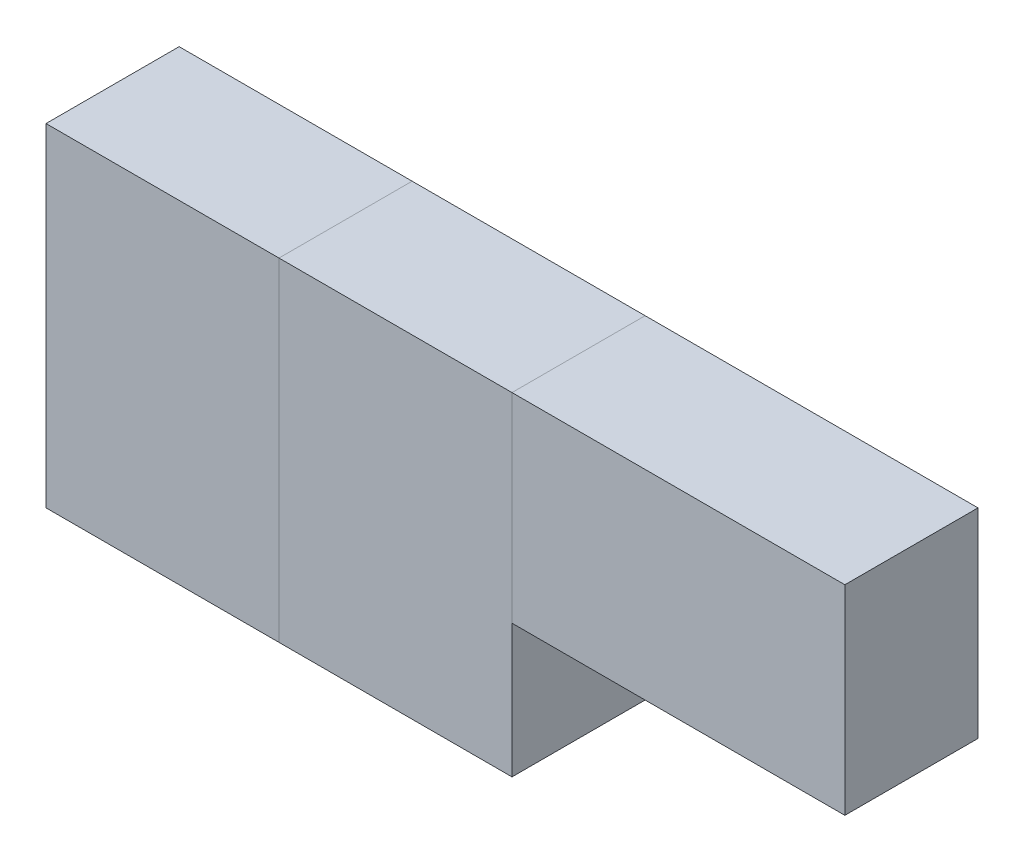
ISO-10303-21;
HEADER;
FILE_DESCRIPTION(('STEP AP214'),'2;1');
FILE_NAME('part.step','',(''),(''),'','','');
FILE_SCHEMA(('AUTOMOTIVE_DESIGN { 1 0 10303 214 1 1 1 1 }'));
ENDSEC;
DATA;
#1=APPLICATION_CONTEXT('core data for automotive mechanical design processes');
#2=APPLICATION_PROTOCOL_DEFINITION('international standard','automotive_design',2000,#1);
#3=PRODUCT_CONTEXT('',#1,'mechanical');
#4=PRODUCT('Part','Part','',(#3));
#5=PRODUCT_RELATED_PRODUCT_CATEGORY('part','',(#4));
#6=PRODUCT_DEFINITION_FORMATION('','',#4);
#7=PRODUCT_DEFINITION_CONTEXT('part definition',#1,'design');
#8=PRODUCT_DEFINITION('design','',#6,#7);
#9=PRODUCT_DEFINITION_SHAPE('','',#8);
#10=(LENGTH_UNIT() NAMED_UNIT(*) SI_UNIT(.MILLI.,.METRE.));
#11=(NAMED_UNIT(*) PLANE_ANGLE_UNIT() SI_UNIT($,.RADIAN.));
#12=(NAMED_UNIT(*) SI_UNIT($,.STERADIAN.) SOLID_ANGLE_UNIT());
#13=UNCERTAINTY_MEASURE_WITH_UNIT(LENGTH_MEASURE(1.E-05),#10,'distance_accuracy_value','');
#14=(GEOMETRIC_REPRESENTATION_CONTEXT(3) GLOBAL_UNCERTAINTY_ASSIGNED_CONTEXT((#13)) GLOBAL_UNIT_ASSIGNED_CONTEXT((#10,
#11,#12)) REPRESENTATION_CONTEXT('',''));
#15=CARTESIAN_POINT('',(0.,0.,0.));
#16=DIRECTION('',(0.,0.,1.));
#17=DIRECTION('',(1.,0.,0.));
#18=AXIS2_PLACEMENT_3D('',#15,#16,#17);
#19=CARTESIAN_POINT('',(1828.8,762.,304.8));
#20=DIRECTION('',(0.,0.,-1.));
#21=DIRECTION('',(-1.,0.,0.));
#22=AXIS2_PLACEMENT_3D('',#19,#20,#21);
#23=PLANE('',#22);
#24=DIRECTION('',(0.,-1.,0.));
#25=VECTOR('',#24,1.);
#26=CARTESIAN_POINT('',(1066.8,762.,304.8));
#27=LINE('',#26,#25);
#28=CARTESIAN_POINT('',(1066.8,762.,304.8));
#29=VERTEX_POINT('',#28);
#30=CARTESIAN_POINT('',(1066.8,304.8,304.8));
#31=VERTEX_POINT('',#30);
#32=EDGE_CURVE('E109',#29,#31,#27,.T.);
#33=ORIENTED_EDGE('',*,*,#32,.T.);
#34=DIRECTION('',(-1.,0.,0.));
#35=VECTOR('',#34,1.);
#36=CARTESIAN_POINT('',(1828.8,304.8,304.8));
#37=LINE('',#36,#35);
#38=CARTESIAN_POINT('',(1828.8,304.8,304.8));
#39=VERTEX_POINT('',#38);
#40=EDGE_CURVE('E12',#39,#31,#37,.T.);
#41=ORIENTED_EDGE('',*,*,#40,.F.);
#42=DIRECTION('',(0.,-1.,0.));
#43=VECTOR('',#42,1.);
#44=CARTESIAN_POINT('',(1828.8,762.,304.8));
#45=LINE('',#44,#43);
#46=CARTESIAN_POINT('',(1828.8,762.,304.8));
#47=VERTEX_POINT('',#46);
#48=EDGE_CURVE('E97',#47,#39,#45,.T.);
#49=ORIENTED_EDGE('',*,*,#48,.F.);
#50=DIRECTION('',(-1.,0.,0.));
#51=VECTOR('',#50,1.);
#52=CARTESIAN_POINT('',(1828.8,762.,304.8));
#53=LINE('',#52,#51);
#54=EDGE_CURVE('E105',#47,#29,#53,.T.);
#55=ORIENTED_EDGE('',*,*,#54,.T.);
#56=EDGE_LOOP('',(#33,#41,#49,#55));
#57=FACE_BOUND('',#56,.T.);
#58=ADVANCED_FACE('F46',(#57),#23,.F.);
#59=CARTESIAN_POINT('',(1828.8,304.8,304.8));
#60=DIRECTION('',(0.,1.,0.));
#61=DIRECTION('',(-1.,0.,0.));
#62=AXIS2_PLACEMENT_3D('',#59,#60,#61);
#63=PLANE('',#62);
#64=DIRECTION('',(0.,0.,-1.));
#65=VECTOR('',#64,1.);
#66=CARTESIAN_POINT('',(1066.8,304.8,304.8));
#67=LINE('',#66,#65);
#68=CARTESIAN_POINT('',(1066.8,304.8,0.));
#69=VERTEX_POINT('',#68);
#70=EDGE_CURVE('E101',#31,#69,#67,.T.);
#71=ORIENTED_EDGE('',*,*,#70,.T.);
#72=DIRECTION('',(-1.,0.,0.));
#73=VECTOR('',#72,1.);
#74=CARTESIAN_POINT('',(1828.8,304.8,0.));
#75=LINE('',#74,#73);
#76=CARTESIAN_POINT('',(1828.8,304.8,0.));
#77=VERTEX_POINT('',#76);
#78=EDGE_CURVE('E54',#77,#69,#75,.T.);
#79=ORIENTED_EDGE('',*,*,#78,.F.);
#80=DIRECTION('',(0.,0.,-1.));
#81=VECTOR('',#80,1.);
#82=CARTESIAN_POINT('',(1828.8,304.8,304.8));
#83=LINE('',#82,#81);
#84=EDGE_CURVE('E92',#39,#77,#83,.T.);
#85=ORIENTED_EDGE('',*,*,#84,.F.);
#86=ORIENTED_EDGE('',*,*,#40,.T.);
#87=EDGE_LOOP('',(#71,#79,#85,#86));
#88=FACE_BOUND('',#87,.T.);
#89=ADVANCED_FACE('F100',(#88),#63,.F.);
#90=CARTESIAN_POINT('',(1828.8,762.,0.));
#91=DIRECTION('',(0.,0.,1.));
#92=DIRECTION('',(1.,0.,0.));
#93=AXIS2_PLACEMENT_3D('',#90,#91,#92);
#94=PLANE('',#93);
#95=DIRECTION('',(0.,1.,0.));
#96=VECTOR('',#95,1.);
#97=CARTESIAN_POINT('',(1066.8,762.,0.));
#98=LINE('',#97,#96);
#99=CARTESIAN_POINT('',(1066.8,762.,0.));
#100=VERTEX_POINT('',#99);
#101=EDGE_CURVE('E79',#69,#100,#98,.T.);
#102=ORIENTED_EDGE('',*,*,#101,.T.);
#103=DIRECTION('',(-1.,0.,0.));
#104=VECTOR('',#103,1.);
#105=CARTESIAN_POINT('',(1828.8,762.,0.));
#106=LINE('',#105,#104);
#107=CARTESIAN_POINT('',(1828.8,762.,0.));
#108=VERTEX_POINT('',#107);
#109=EDGE_CURVE('E102',#108,#100,#106,.T.);
#110=ORIENTED_EDGE('',*,*,#109,.F.);
#111=DIRECTION('',(0.,1.,0.));
#112=VECTOR('',#111,1.);
#113=CARTESIAN_POINT('',(1828.8,762.,0.));
#114=LINE('',#113,#112);
#115=EDGE_CURVE('E95',#77,#108,#114,.T.);
#116=ORIENTED_EDGE('',*,*,#115,.F.);
#117=ORIENTED_EDGE('',*,*,#78,.T.);
#118=EDGE_LOOP('',(#102,#110,#116,#117));
#119=FACE_BOUND('',#118,.T.);
#120=ADVANCED_FACE('F103',(#119),#94,.F.);
#121=CARTESIAN_POINT('',(1828.8,762.,304.8));
#122=DIRECTION('',(0.,-1.,0.));
#123=DIRECTION('',(1.,0.,0.));
#124=AXIS2_PLACEMENT_3D('',#121,#122,#123);
#125=PLANE('',#124);
#126=DIRECTION('',(0.,0.,1.));
#127=VECTOR('',#126,1.);
#128=CARTESIAN_POINT('',(1066.8,762.,304.8));
#129=LINE('',#128,#127);
#130=EDGE_CURVE('E85',#100,#29,#129,.T.);
#131=ORIENTED_EDGE('',*,*,#130,.T.);
#132=ORIENTED_EDGE('',*,*,#54,.F.);
#133=DIRECTION('',(0.,0.,1.));
#134=VECTOR('',#133,1.);
#135=CARTESIAN_POINT('',(1828.8,762.,304.8));
#136=LINE('',#135,#134);
#137=EDGE_CURVE('E62',#108,#47,#136,.T.);
#138=ORIENTED_EDGE('',*,*,#137,.F.);
#139=ORIENTED_EDGE('',*,*,#109,.T.);
#140=EDGE_LOOP('',(#131,#132,#138,#139));
#141=FACE_BOUND('',#140,.T.);
#142=ADVANCED_FACE('F116',(#141),#125,.F.);
#143=CARTESIAN_POINT('',(1828.8,304.8,304.8));
#144=DIRECTION('',(1.,0.,0.));
#145=DIRECTION('',(0.,1.,0.));
#146=AXIS2_PLACEMENT_3D('',#143,#144,#145);
#147=PLANE('',#146);
#148=ORIENTED_EDGE('',*,*,#48,.T.);
#149=ORIENTED_EDGE('',*,*,#84,.T.);
#150=ORIENTED_EDGE('',*,*,#115,.T.);
#151=ORIENTED_EDGE('',*,*,#137,.T.);
#152=EDGE_LOOP('',(#148,#149,#150,#151));
#153=FACE_BOUND('',#152,.T.);
#154=ADVANCED_FACE('F93',(#153),#147,.T.);
#155=CARTESIAN_POINT('',(1066.8,304.8,304.8));
#156=DIRECTION('',(1.,0.,0.));
#157=DIRECTION('',(0.,1.,0.));
#158=AXIS2_PLACEMENT_3D('',#155,#156,#157);
#159=PLANE('',#158);
#160=ORIENTED_EDGE('',*,*,#32,.F.);
#161=ORIENTED_EDGE('',*,*,#130,.F.);
#162=ORIENTED_EDGE('',*,*,#101,.F.);
#163=ORIENTED_EDGE('',*,*,#70,.F.);
#164=EDGE_LOOP('',(#160,#161,#162,#163));
#165=FACE_BOUND('',#164,.T.);
#166=ADVANCED_FACE('F119',(#165),#159,.F.);
#167=CLOSED_SHELL('',(#58,#89,#120,#142,#154,#166));
#168=MANIFOLD_SOLID_BREP('B2',#167);
#169=CARTESIAN_POINT('',(533.4,762.,304.8));
#170=DIRECTION('',(1.,0.,0.));
#171=DIRECTION('',(0.,1.,0.));
#172=AXIS2_PLACEMENT_3D('',#169,#170,#171);
#173=PLANE('',#172);
#174=DIRECTION('',(0.,-1.,0.));
#175=VECTOR('',#174,1.);
#176=CARTESIAN_POINT('',(533.4,762.,0.));
#177=LINE('',#176,#175);
#178=CARTESIAN_POINT('',(533.4,762.,0.));
#179=VERTEX_POINT('',#178);
#180=CARTESIAN_POINT('',(533.4,0.,0.));
#181=VERTEX_POINT('',#180);
#182=EDGE_CURVE('E244',#179,#181,#177,.T.);
#183=ORIENTED_EDGE('',*,*,#182,.T.);
#184=DIRECTION('',(0.,0.,-1.));
#185=VECTOR('',#184,1.);
#186=CARTESIAN_POINT('',(533.4,0.,304.8));
#187=LINE('',#186,#185);
#188=CARTESIAN_POINT('',(533.4,0.,304.8));
#189=VERTEX_POINT('',#188);
#190=EDGE_CURVE('E44',#189,#181,#187,.T.);
#191=ORIENTED_EDGE('',*,*,#190,.F.);
#192=DIRECTION('',(0.,-1.,0.));
#193=VECTOR('',#192,1.);
#194=CARTESIAN_POINT('',(533.4,762.,304.8));
#195=LINE('',#194,#193);
#196=CARTESIAN_POINT('',(533.4,762.,304.8));
#197=VERTEX_POINT('',#196);
#198=EDGE_CURVE('E232',#197,#189,#195,.T.);
#199=ORIENTED_EDGE('',*,*,#198,.F.);
#200=DIRECTION('',(0.,0.,-1.));
#201=VECTOR('',#200,1.);
#202=CARTESIAN_POINT('',(533.4,762.,304.8));
#203=LINE('',#202,#201);
#204=EDGE_CURVE('E240',#197,#179,#203,.T.);
#205=ORIENTED_EDGE('',*,*,#204,.T.);
#206=EDGE_LOOP('',(#183,#191,#199,#205));
#207=FACE_BOUND('',#206,.T.);
#208=ADVANCED_FACE('F181',(#207),#173,.F.);
#209=CARTESIAN_POINT('',(533.4,0.,304.8));
#210=DIRECTION('',(0.,1.,0.));
#211=DIRECTION('',(0.,0.,1.));
#212=AXIS2_PLACEMENT_3D('',#209,#210,#211);
#213=PLANE('',#212);
#214=DIRECTION('',(1.,0.,0.));
#215=VECTOR('',#214,1.);
#216=CARTESIAN_POINT('',(533.4,0.,0.));
#217=LINE('',#216,#215);
#218=CARTESIAN_POINT('',(1066.8,0.,0.));
#219=VERTEX_POINT('',#218);
#220=EDGE_CURVE('E236',#181,#219,#217,.T.);
#221=ORIENTED_EDGE('',*,*,#220,.T.);
#222=DIRECTION('',(0.,0.,-1.));
#223=VECTOR('',#222,1.);
#224=CARTESIAN_POINT('',(1066.8,0.,304.8));
#225=LINE('',#224,#223);
#226=CARTESIAN_POINT('',(1066.8,0.,304.8));
#227=VERTEX_POINT('',#226);
#228=EDGE_CURVE('E189',#227,#219,#225,.T.);
#229=ORIENTED_EDGE('',*,*,#228,.F.);
#230=DIRECTION('',(1.,0.,0.));
#231=VECTOR('',#230,1.);
#232=CARTESIAN_POINT('',(533.4,0.,304.8));
#233=LINE('',#232,#231);
#234=EDGE_CURVE('E227',#189,#227,#233,.T.);
#235=ORIENTED_EDGE('',*,*,#234,.F.);
#236=ORIENTED_EDGE('',*,*,#190,.T.);
#237=EDGE_LOOP('',(#221,#229,#235,#236));
#238=FACE_BOUND('',#237,.T.);
#239=ADVANCED_FACE('F235',(#238),#213,.F.);
#240=CARTESIAN_POINT('',(1066.8,762.,304.8));
#241=DIRECTION('',(-1.,0.,0.));
#242=DIRECTION('',(0.,-1.,0.));
#243=AXIS2_PLACEMENT_3D('',#240,#241,#242);
#244=PLANE('',#243);
#245=DIRECTION('',(0.,1.,0.));
#246=VECTOR('',#245,1.);
#247=CARTESIAN_POINT('',(1066.8,762.,0.));
#248=LINE('',#247,#246);
#249=CARTESIAN_POINT('',(1066.8,762.,0.));
#250=VERTEX_POINT('',#249);
#251=EDGE_CURVE('E214',#219,#250,#248,.T.);
#252=ORIENTED_EDGE('',*,*,#251,.T.);
#253=DIRECTION('',(0.,0.,-1.));
#254=VECTOR('',#253,1.);
#255=CARTESIAN_POINT('',(1066.8,762.,304.8));
#256=LINE('',#255,#254);
#257=CARTESIAN_POINT('',(1066.8,762.,304.8));
#258=VERTEX_POINT('',#257);
#259=EDGE_CURVE('E237',#258,#250,#256,.T.);
#260=ORIENTED_EDGE('',*,*,#259,.F.);
#261=DIRECTION('',(0.,1.,0.));
#262=VECTOR('',#261,1.);
#263=CARTESIAN_POINT('',(1066.8,762.,304.8));
#264=LINE('',#263,#262);
#265=EDGE_CURVE('E230',#227,#258,#264,.T.);
#266=ORIENTED_EDGE('',*,*,#265,.F.);
#267=ORIENTED_EDGE('',*,*,#228,.T.);
#268=EDGE_LOOP('',(#252,#260,#266,#267));
#269=FACE_BOUND('',#268,.T.);
#270=ADVANCED_FACE('F238',(#269),#244,.F.);
#271=CARTESIAN_POINT('',(533.4,762.,304.8));
#272=DIRECTION('',(0.,-1.,0.));
#273=DIRECTION('',(0.,0.,-1.));
#274=AXIS2_PLACEMENT_3D('',#271,#272,#273);
#275=PLANE('',#274);
#276=DIRECTION('',(-1.,0.,0.));
#277=VECTOR('',#276,1.);
#278=CARTESIAN_POINT('',(533.4,762.,0.));
#279=LINE('',#278,#277);
#280=EDGE_CURVE('E220',#250,#179,#279,.T.);
#281=ORIENTED_EDGE('',*,*,#280,.T.);
#282=ORIENTED_EDGE('',*,*,#204,.F.);
#283=DIRECTION('',(-1.,0.,0.));
#284=VECTOR('',#283,1.);
#285=CARTESIAN_POINT('',(533.4,762.,304.8));
#286=LINE('',#285,#284);
#287=EDGE_CURVE('E197',#258,#197,#286,.T.);
#288=ORIENTED_EDGE('',*,*,#287,.F.);
#289=ORIENTED_EDGE('',*,*,#259,.T.);
#290=EDGE_LOOP('',(#281,#282,#288,#289));
#291=FACE_BOUND('',#290,.T.);
#292=ADVANCED_FACE('F251',(#291),#275,.F.);
#293=CARTESIAN_POINT('',(533.4,0.,304.8));
#294=DIRECTION('',(0.,0.,1.));
#295=DIRECTION('',(1.,0.,0.));
#296=AXIS2_PLACEMENT_3D('',#293,#294,#295);
#297=PLANE('',#296);
#298=ORIENTED_EDGE('',*,*,#198,.T.);
#299=ORIENTED_EDGE('',*,*,#234,.T.);
#300=ORIENTED_EDGE('',*,*,#265,.T.);
#301=ORIENTED_EDGE('',*,*,#287,.T.);
#302=EDGE_LOOP('',(#298,#299,#300,#301));
#303=FACE_BOUND('',#302,.T.);
#304=ADVANCED_FACE('F228',(#303),#297,.T.);
#305=CARTESIAN_POINT('',(533.4,0.,0.));
#306=DIRECTION('',(0.,0.,1.));
#307=DIRECTION('',(1.,0.,0.));
#308=AXIS2_PLACEMENT_3D('',#305,#306,#307);
#309=PLANE('',#308);
#310=ORIENTED_EDGE('',*,*,#182,.F.);
#311=ORIENTED_EDGE('',*,*,#280,.F.);
#312=ORIENTED_EDGE('',*,*,#251,.F.);
#313=ORIENTED_EDGE('',*,*,#220,.F.);
#314=EDGE_LOOP('',(#310,#311,#312,#313));
#315=FACE_BOUND('',#314,.T.);
#316=ADVANCED_FACE('F254',(#315),#309,.F.);
#317=CLOSED_SHELL('',(#208,#239,#270,#292,#304,#316));
#318=MANIFOLD_SOLID_BREP('B6',#317);
#319=CARTESIAN_POINT('',(0.,762.,304.8));
#320=DIRECTION('',(1.,0.,0.));
#321=DIRECTION('',(0.,1.,0.));
#322=AXIS2_PLACEMENT_3D('',#319,#320,#321);
#323=PLANE('',#322);
#324=DIRECTION('',(0.,-1.,0.));
#325=VECTOR('',#324,1.);
#326=CARTESIAN_POINT('',(0.,762.,0.));
#327=LINE('',#326,#325);
#328=CARTESIAN_POINT('',(0.,762.,0.));
#329=VERTEX_POINT('',#328);
#330=CARTESIAN_POINT('',(0.,0.,0.));
#331=VERTEX_POINT('',#330);
#332=EDGE_CURVE('E370',#329,#331,#327,.T.);
#333=ORIENTED_EDGE('',*,*,#332,.T.);
#334=DIRECTION('',(0.,0.,-1.));
#335=VECTOR('',#334,1.);
#336=CARTESIAN_POINT('',(0.,0.,304.8));
#337=LINE('',#336,#335);
#338=CARTESIAN_POINT('',(0.,0.,304.8));
#339=VERTEX_POINT('',#338);
#340=EDGE_CURVE('E179',#339,#331,#337,.T.);
#341=ORIENTED_EDGE('',*,*,#340,.F.);
#342=DIRECTION('',(0.,-1.,0.));
#343=VECTOR('',#342,1.);
#344=CARTESIAN_POINT('',(0.,762.,304.8));
#345=LINE('',#344,#343);
#346=CARTESIAN_POINT('',(0.,762.,304.8));
#347=VERTEX_POINT('',#346);
#348=EDGE_CURVE('E358',#347,#339,#345,.T.);
#349=ORIENTED_EDGE('',*,*,#348,.F.);
#350=DIRECTION('',(0.,0.,-1.));
#351=VECTOR('',#350,1.);
#352=CARTESIAN_POINT('',(0.,762.,304.8));
#353=LINE('',#352,#351);
#354=EDGE_CURVE('E366',#347,#329,#353,.T.);
#355=ORIENTED_EDGE('',*,*,#354,.T.);
#356=EDGE_LOOP('',(#333,#341,#349,#355));
#357=FACE_BOUND('',#356,.T.);
#358=ADVANCED_FACE('F307',(#357),#323,.F.);
#359=CARTESIAN_POINT('',(0.,0.,304.8));
#360=DIRECTION('',(0.,1.,0.));
#361=DIRECTION('',(0.,0.,1.));
#362=AXIS2_PLACEMENT_3D('',#359,#360,#361);
#363=PLANE('',#362);
#364=DIRECTION('',(1.,0.,0.));
#365=VECTOR('',#364,1.);
#366=CARTESIAN_POINT('',(0.,0.,0.));
#367=LINE('',#366,#365);
#368=CARTESIAN_POINT('',(533.4,0.,0.));
#369=VERTEX_POINT('',#368);
#370=EDGE_CURVE('E362',#331,#369,#367,.T.);
#371=ORIENTED_EDGE('',*,*,#370,.T.);
#372=DIRECTION('',(0.,0.,-1.));
#373=VECTOR('',#372,1.);
#374=CARTESIAN_POINT('',(533.4,0.,304.8));
#375=LINE('',#374,#373);
#376=CARTESIAN_POINT('',(533.4,0.,304.8));
#377=VERTEX_POINT('',#376);
#378=EDGE_CURVE('E315',#377,#369,#375,.T.);
#379=ORIENTED_EDGE('',*,*,#378,.F.);
#380=DIRECTION('',(1.,0.,0.));
#381=VECTOR('',#380,1.);
#382=CARTESIAN_POINT('',(0.,0.,304.8));
#383=LINE('',#382,#381);
#384=EDGE_CURVE('E353',#339,#377,#383,.T.);
#385=ORIENTED_EDGE('',*,*,#384,.F.);
#386=ORIENTED_EDGE('',*,*,#340,.T.);
#387=EDGE_LOOP('',(#371,#379,#385,#386));
#388=FACE_BOUND('',#387,.T.);
#389=ADVANCED_FACE('F361',(#388),#363,.F.);
#390=CARTESIAN_POINT('',(533.4,762.,304.8));
#391=DIRECTION('',(-1.,0.,0.));
#392=DIRECTION('',(0.,-1.,0.));
#393=AXIS2_PLACEMENT_3D('',#390,#391,#392);
#394=PLANE('',#393);
#395=DIRECTION('',(0.,1.,0.));
#396=VECTOR('',#395,1.);
#397=CARTESIAN_POINT('',(533.4,762.,0.));
#398=LINE('',#397,#396);
#399=CARTESIAN_POINT('',(533.4,762.,0.));
#400=VERTEX_POINT('',#399);
#401=EDGE_CURVE('E340',#369,#400,#398,.T.);
#402=ORIENTED_EDGE('',*,*,#401,.T.);
#403=DIRECTION('',(0.,0.,-1.));
#404=VECTOR('',#403,1.);
#405=CARTESIAN_POINT('',(533.4,762.,304.8));
#406=LINE('',#405,#404);
#407=CARTESIAN_POINT('',(533.4,762.,304.8));
#408=VERTEX_POINT('',#407);
#409=EDGE_CURVE('E363',#408,#400,#406,.T.);
#410=ORIENTED_EDGE('',*,*,#409,.F.);
#411=DIRECTION('',(0.,1.,0.));
#412=VECTOR('',#411,1.);
#413=CARTESIAN_POINT('',(533.4,762.,304.8));
#414=LINE('',#413,#412);
#415=EDGE_CURVE('E356',#377,#408,#414,.T.);
#416=ORIENTED_EDGE('',*,*,#415,.F.);
#417=ORIENTED_EDGE('',*,*,#378,.T.);
#418=EDGE_LOOP('',(#402,#410,#416,#417));
#419=FACE_BOUND('',#418,.T.);
#420=ADVANCED_FACE('F364',(#419),#394,.F.);
#421=CARTESIAN_POINT('',(0.,762.,304.8));
#422=DIRECTION('',(0.,-1.,0.));
#423=DIRECTION('',(0.,0.,-1.));
#424=AXIS2_PLACEMENT_3D('',#421,#422,#423);
#425=PLANE('',#424);
#426=DIRECTION('',(-1.,0.,0.));
#427=VECTOR('',#426,1.);
#428=CARTESIAN_POINT('',(0.,762.,0.));
#429=LINE('',#428,#427);
#430=EDGE_CURVE('E346',#400,#329,#429,.T.);
#431=ORIENTED_EDGE('',*,*,#430,.T.);
#432=ORIENTED_EDGE('',*,*,#354,.F.);
#433=DIRECTION('',(-1.,0.,0.));
#434=VECTOR('',#433,1.);
#435=CARTESIAN_POINT('',(0.,762.,304.8));
#436=LINE('',#435,#434);
#437=EDGE_CURVE('E323',#408,#347,#436,.T.);
#438=ORIENTED_EDGE('',*,*,#437,.F.);
#439=ORIENTED_EDGE('',*,*,#409,.T.);
#440=EDGE_LOOP('',(#431,#432,#438,#439));
#441=FACE_BOUND('',#440,.T.);
#442=ADVANCED_FACE('F377',(#441),#425,.F.);
#443=CARTESIAN_POINT('',(0.,0.,304.8));
#444=DIRECTION('',(0.,0.,1.));
#445=DIRECTION('',(1.,0.,0.));
#446=AXIS2_PLACEMENT_3D('',#443,#444,#445);
#447=PLANE('',#446);
#448=ORIENTED_EDGE('',*,*,#348,.T.);
#449=ORIENTED_EDGE('',*,*,#384,.T.);
#450=ORIENTED_EDGE('',*,*,#415,.T.);
#451=ORIENTED_EDGE('',*,*,#437,.T.);
#452=EDGE_LOOP('',(#448,#449,#450,#451));
#453=FACE_BOUND('',#452,.T.);
#454=ADVANCED_FACE('F354',(#453),#447,.T.);
#455=CARTESIAN_POINT('',(0.,0.,0.));
#456=DIRECTION('',(0.,0.,1.));
#457=DIRECTION('',(1.,0.,0.));
#458=AXIS2_PLACEMENT_3D('',#455,#456,#457);
#459=PLANE('',#458);
#460=ORIENTED_EDGE('',*,*,#332,.F.);
#461=ORIENTED_EDGE('',*,*,#430,.F.);
#462=ORIENTED_EDGE('',*,*,#401,.F.);
#463=ORIENTED_EDGE('',*,*,#370,.F.);
#464=EDGE_LOOP('',(#460,#461,#462,#463));
#465=FACE_BOUND('',#464,.T.);
#466=ADVANCED_FACE('F380',(#465),#459,.F.);
#467=CLOSED_SHELL('',(#358,#389,#420,#442,#454,#466));
#468=MANIFOLD_SOLID_BREP('B38',#467);
#469=ADVANCED_BREP_SHAPE_REPRESENTATION('',(#18,#168,#318,#468),#14);
#470=SHAPE_DEFINITION_REPRESENTATION(#9,#469);
ENDSEC;
END-ISO-10303-21;
